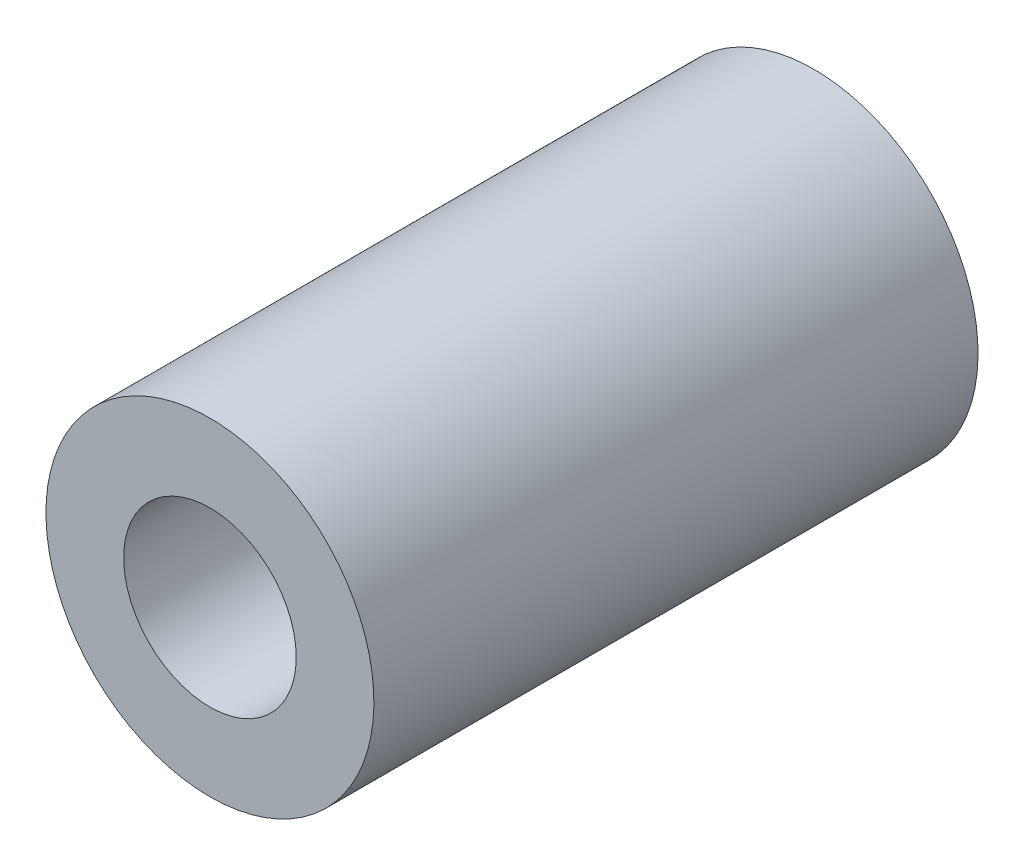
ISO-10303-21;
HEADER;
FILE_DESCRIPTION(('STEP AP214'),'2;1');
FILE_NAME('part.step','',(''),(''),'','','');
FILE_SCHEMA(('AUTOMOTIVE_DESIGN { 1 0 10303 214 1 1 1 1 }'));
ENDSEC;
DATA;
#1=APPLICATION_CONTEXT('core data for automotive mechanical design processes');
#2=APPLICATION_PROTOCOL_DEFINITION('international standard','automotive_design',2000,#1);
#3=PRODUCT_CONTEXT('',#1,'mechanical');
#4=PRODUCT('Part','Part','',(#3));
#5=PRODUCT_RELATED_PRODUCT_CATEGORY('part','',(#4));
#6=PRODUCT_DEFINITION_FORMATION('','',#4);
#7=PRODUCT_DEFINITION_CONTEXT('part definition',#1,'design');
#8=PRODUCT_DEFINITION('design','',#6,#7);
#9=PRODUCT_DEFINITION_SHAPE('','',#8);
#10=(LENGTH_UNIT() NAMED_UNIT(*) SI_UNIT(.MILLI.,.METRE.));
#11=(NAMED_UNIT(*) PLANE_ANGLE_UNIT() SI_UNIT($,.RADIAN.));
#12=(NAMED_UNIT(*) SI_UNIT($,.STERADIAN.) SOLID_ANGLE_UNIT());
#13=UNCERTAINTY_MEASURE_WITH_UNIT(LENGTH_MEASURE(1.E-05),#10,'distance_accuracy_value','');
#14=(GEOMETRIC_REPRESENTATION_CONTEXT(3) GLOBAL_UNCERTAINTY_ASSIGNED_CONTEXT((#13)) GLOBAL_UNIT_ASSIGNED_CONTEXT((#10,
#11,#12)) REPRESENTATION_CONTEXT('',''));
#15=CARTESIAN_POINT('',(0.,0.,0.));
#16=DIRECTION('',(0.,0.,1.));
#17=DIRECTION('',(1.,0.,0.));
#18=AXIS2_PLACEMENT_3D('',#15,#16,#17);
#19=CARTESIAN_POINT('',(0.,0.,35.));
#20=DIRECTION('',(0.,0.,1.));
#21=DIRECTION('',(0.,-1.,0.));
#22=AXIS2_PLACEMENT_3D('',#19,#20,#21);
#23=CYLINDRICAL_SURFACE('',#22,5.);
#24=CARTESIAN_POINT('',(0.,0.,20.));
#25=DIRECTION('',(0.,0.,1.));
#26=DIRECTION('',(1.,0.,0.));
#27=AXIS2_PLACEMENT_3D('',#24,#25,#26);
#28=CIRCLE('',#27,5.);
#29=CARTESIAN_POINT('',(5.,0.,20.));
#30=VERTEX_POINT('',#29);
#31=EDGE_CURVE('E27',#30,#30,#28,.T.);
#32=ORIENTED_EDGE('',*,*,#31,.F.);
#33=EDGE_LOOP('',(#32));
#34=FACE_BOUND('',#33,.T.);
#35=CARTESIAN_POINT('',(0.,0.,35.));
#36=DIRECTION('',(0.,0.,1.));
#37=DIRECTION('',(1.,0.,0.));
#38=AXIS2_PLACEMENT_3D('',#35,#36,#37);
#39=CIRCLE('',#38,5.);
#40=CARTESIAN_POINT('',(5.,0.,35.));
#41=VERTEX_POINT('',#40);
#42=EDGE_CURVE('E23',#41,#41,#39,.F.);
#43=ORIENTED_EDGE('',*,*,#42,.F.);
#44=EDGE_LOOP('',(#43));
#45=FACE_BOUND('',#44,.T.);
#46=ADVANCED_FACE('F12',(#34,#45),#23,.F.);
#47=CARTESIAN_POINT('',(0.,0.,0.));
#48=DIRECTION('',(0.,0.,1.));
#49=DIRECTION('',(0.,-1.,0.));
#50=AXIS2_PLACEMENT_3D('',#47,#48,#49);
#51=PLANE('',#50);
#52=CARTESIAN_POINT('',(0.,0.,0.));
#53=DIRECTION('',(0.,0.,1.));
#54=DIRECTION('',(0.,-1.,0.));
#55=AXIS2_PLACEMENT_3D('',#52,#53,#54);
#56=CIRCLE('',#55,9.5);
#57=CARTESIAN_POINT('',(0.,-9.5,0.));
#58=VERTEX_POINT('',#57);
#59=EDGE_CURVE('E19',#58,#58,#56,.T.);
#60=ORIENTED_EDGE('',*,*,#59,.F.);
#61=EDGE_LOOP('',(#60));
#62=FACE_BOUND('',#61,.T.);
#63=ADVANCED_FACE('F37',(#62),#51,.F.);
#64=CARTESIAN_POINT('',(0.,0.,35.));
#65=DIRECTION('',(0.,0.,1.));
#66=DIRECTION('',(0.,-1.,0.));
#67=AXIS2_PLACEMENT_3D('',#64,#65,#66);
#68=PLANE('',#67);
#69=CARTESIAN_POINT('',(0.,0.,35.));
#70=DIRECTION('',(0.,0.,1.));
#71=DIRECTION('',(0.,-1.,0.));
#72=AXIS2_PLACEMENT_3D('',#69,#70,#71);
#73=CIRCLE('',#72,9.5);
#74=CARTESIAN_POINT('',(0.,-9.5,35.));
#75=VERTEX_POINT('',#74);
#76=EDGE_CURVE('E8',#75,#75,#73,.T.);
#77=ORIENTED_EDGE('',*,*,#76,.T.);
#78=EDGE_LOOP('',(#77));
#79=FACE_BOUND('',#78,.T.);
#80=ORIENTED_EDGE('',*,*,#42,.T.);
#81=EDGE_LOOP('',(#80));
#82=FACE_BOUND('',#81,.T.);
#83=ADVANCED_FACE('F41',(#79,#82),#68,.T.);
#84=CARTESIAN_POINT('',(0.,0.,35.));
#85=DIRECTION('',(0.,0.,-1.));
#86=DIRECTION('',(0.,1.,0.));
#87=AXIS2_PLACEMENT_3D('',#84,#85,#86);
#88=CYLINDRICAL_SURFACE('',#87,9.5);
#89=ORIENTED_EDGE('',*,*,#76,.F.);
#90=EDGE_LOOP('',(#89));
#91=FACE_BOUND('',#90,.T.);
#92=ORIENTED_EDGE('',*,*,#59,.T.);
#93=EDGE_LOOP('',(#92));
#94=FACE_BOUND('',#93,.T.);
#95=ADVANCED_FACE('F14',(#91,#94),#88,.T.);
#96=CARTESIAN_POINT('',(0.,0.,20.));
#97=DIRECTION('',(0.,0.,1.));
#98=DIRECTION('',(1.,0.,0.));
#99=AXIS2_PLACEMENT_3D('',#96,#97,#98);
#100=PLANE('',#99);
#101=ORIENTED_EDGE('',*,*,#31,.T.);
#102=EDGE_LOOP('',(#101));
#103=FACE_BOUND('',#102,.T.);
#104=ADVANCED_FACE('F33',(#103),#100,.T.);
#105=CLOSED_SHELL('',(#46,#63,#83,#95,#104));
#106=MANIFOLD_SOLID_BREP('B1',#105);
#107=ADVANCED_BREP_SHAPE_REPRESENTATION('',(#18,#106),#14);
#108=SHAPE_DEFINITION_REPRESENTATION(#9,#107);
ENDSEC;
END-ISO-10303-21;
